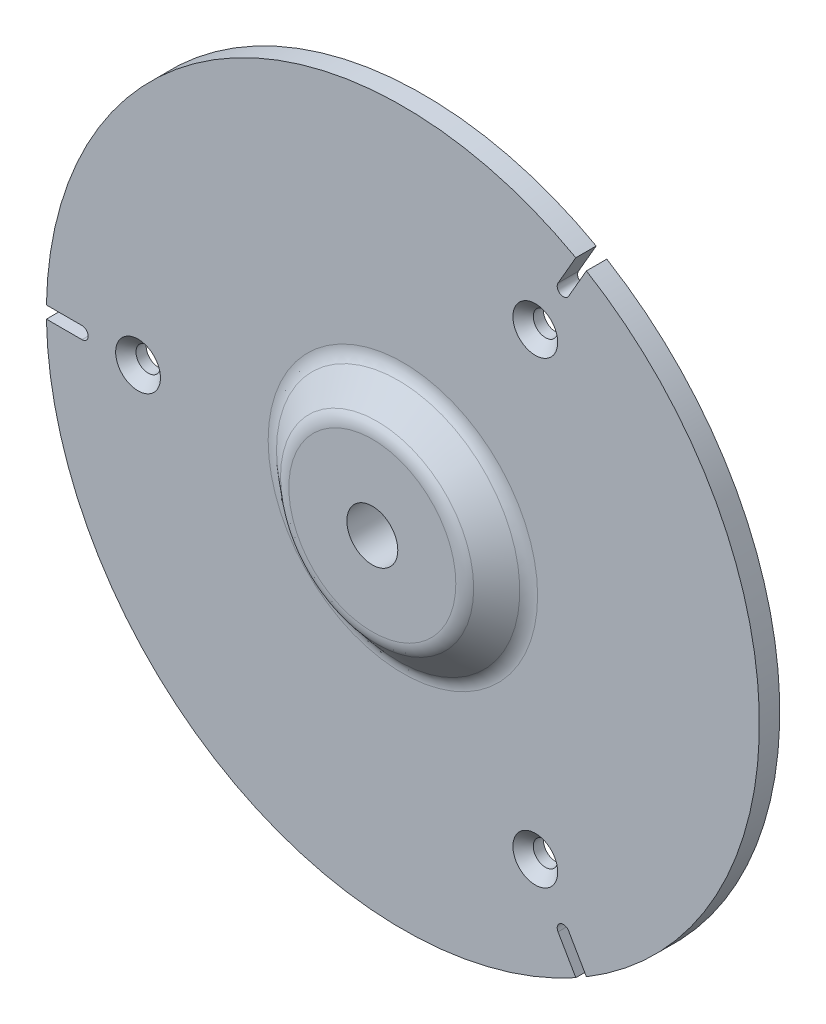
from build123d import *

# Parameters (mm, degrees)
ESQUISSE1_R                  = 35
EXTRUSION1_DEPTH             = 2
ESQUISSE2_R                  = 12.5
EXTRUSION2_DEPTH             = 3
EXTRUSION2_TAPER             = 50
CONG_1_R                     = 2
TROU_TARAUD_M61_D            = 5
ENL_V_MAT_EXTRU_1_REACH      = 51.588
R_P_TITION_CIRCULAIRE1_COUNT = 3


with BuildPart() as part:
    # Esquisse1 → Extrusion1 (new body)
    with BuildSketch(Plane.XY):
        with Locations(Location((0, 0, 0), (0, 0, 180))):
            Circle(ESQUISSE1_R)
    extrude(amount=EXTRUSION1_DEPTH)

    # Esquisse2 → Extrusion2 (add)
    with BuildSketch(Plane.XY.offset(2)):
        Circle(ESQUISSE2_R)
    extrude(amount=EXTRUSION2_DEPTH, taper=EXTRUSION2_TAPER)

    # Cong_1
    cong_1_edges = [part.edges().sort_by_distance(p)[0] for p in [
        (-8.924739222, 0, 5),
        (-12.5, 0, 2),
    ]]
    fillet(cong_1_edges, radius=CONG_1_R)

    # Trou taraud_ M61 (through all)
    with Locations(Plane.XY.offset(5)):
        with Locations((0, 0)):
            Hole(TROU_TARAUD_M61_D / 2)

    # Esquisse5 → Enl_v. mat.-Extru.1 (cut, up to next)
    with BuildSketch(Plane.XY.offset(2), mode=Mode.PRIVATE) as enl_v_mat_extru_1_sk1:
        with BuildLine():
            Line((-34.994856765, 0.6), (-31.5, 0.6))
            ThreePointArc((-31.5, 0.6), (-30.9, 0), (-31.5, -0.6))
            Line((-31.5, -0.6), (-34.994856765, -0.6))
            ThreePointArc((-34.994856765, -0.6), (-35, 0), (-34.994856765, 0.6))
        make_face()
    enl_v_mat_extru_1_tool1 = extrude(enl_v_mat_extru_1_sk1.sketch, amount=-ENL_V_MAT_EXTRU_1_REACH, mode=Mode.PRIVATE) & part.part
    enl_v_mat_extru_1 = enl_v_mat_extru_1_tool1.solids().sort_by_distance((-33.011265, 0, 2))[0]
    add(enl_v_mat_extru_1, mode=Mode.SUBTRACT)

    # Esquisse6 → Fraisage pour vis _ t_te frais_e M21 (revolve, cut)
    with BuildSketch(Plane(origin=(-26, 0, 2), x_dir=(0, -1, 0), z_dir=(1, 0, 0))):
        Polygon((0, 0), (0, 2), (1.2, 2), (1.2, 1), (2.2, 0), align=None)
    fraisage_pour_vis_t_te_frais_e_m21 = revolve(axis=Axis((-26, 0, 8.35), (0, 0, -1)), mode=Mode.SUBTRACT)

    # R_p_tition circulaire1: Enl_v. mat.-Extru.1, Fraisage pour vis _ t_te frais_e M21 ×3 about axis
    r_p_tition_circulaire1_axis = Axis((0, 0, 0), (0, 0, 1))
    add([enl_v_mat_extru_1.rotate(r_p_tition_circulaire1_axis, i * 360 / R_P_TITION_CIRCULAIRE1_COUNT) for i in range(1, R_P_TITION_CIRCULAIRE1_COUNT)], mode=Mode.SUBTRACT)
    add([fraisage_pour_vis_t_te_frais_e_m21.rotate(r_p_tition_circulaire1_axis, i * 360 / R_P_TITION_CIRCULAIRE1_COUNT) for i in range(1, R_P_TITION_CIRCULAIRE1_COUNT)], mode=Mode.SUBTRACT)


solid = part.part
